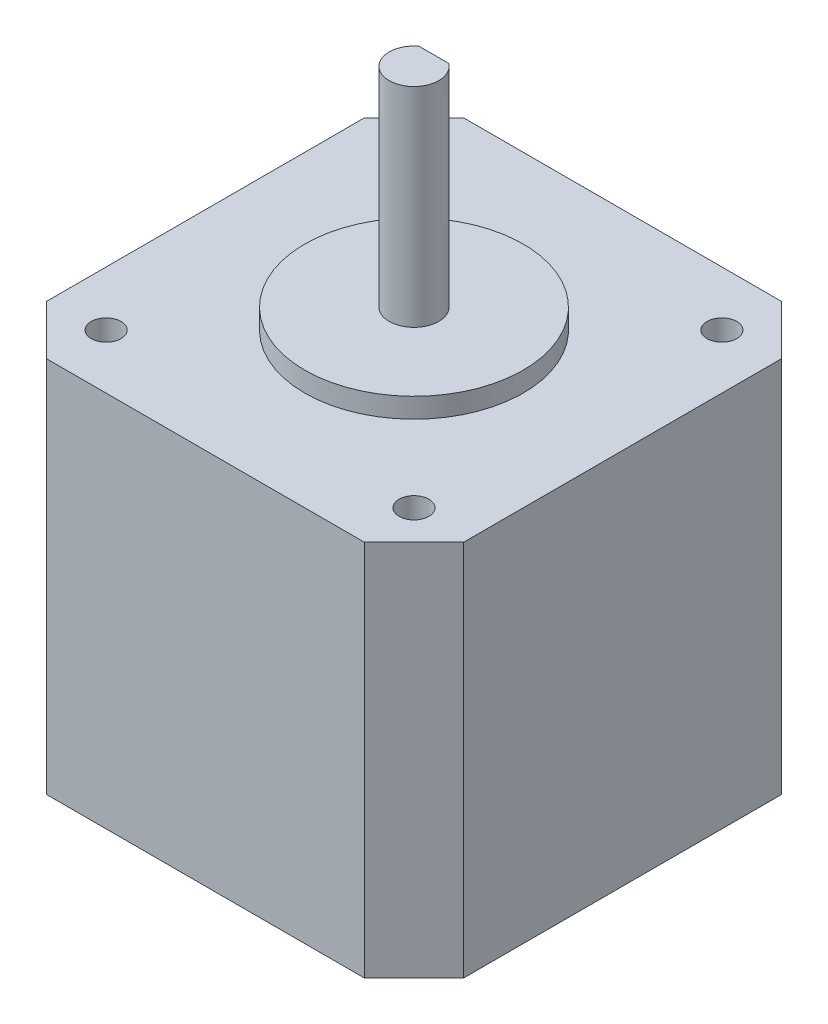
from build123d import *

# Parameters (mm, degrees)
SCHIZZO1_W                   = 42
SCHIZZO1_H                   = 42
ESTRUSIONE_ESTRUSIONE1_DEPTH = 38
SCHIZZO2_R                   = 11
ESTRUSIONE_ESTRUSIONE2_DEPTH = 2
SCHIZZO3_R                   = 2.5
ESTRUSIONE_ESTRUSIONE3_DEPTH = 21
SCHIZZO5_R                   = 1.5
TAGLIO_ESTRUSIONE8_DEPTH     = 10
SMUSSO1_SIZE                 = 5
SCHIZZO6_W                   = 6.915794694
SCHIZZO6_H                   = 1.569442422
TAGLIO_ESTRUSIONE9_DEPTH     = 19


with BuildPart() as part:
    # Schizzo1 → Estrusione-Estrusione1 (new body)
    with BuildSketch(Plane(origin=(0, 0, 0), x_dir=(1, 0, 0), z_dir=(0, 1, 0))):
        Rectangle(SCHIZZO1_W, SCHIZZO1_H)
    extrude(amount=ESTRUSIONE_ESTRUSIONE1_DEPTH)

    # Schizzo2 → Estrusione-Estrusione2 (add)
    with BuildSketch(Plane(origin=(0, 38, 0), x_dir=(1, 0, 0), z_dir=(0, 1, 0))):
        with Locations(Location((0, 0, 0), (0, 0, 270))):
            Circle(SCHIZZO2_R)
    extrude(amount=ESTRUSIONE_ESTRUSIONE2_DEPTH)

    # Schizzo3 → Estrusione-Estrusione3 (add)
    with BuildSketch(Plane(origin=(0, 40, 0), x_dir=(1, 0, 0), z_dir=(0, 1, 0))):
        with Locations(Location((0, 0, 0), (0, 0, 90))):
            Circle(SCHIZZO3_R)
    extrude(amount=ESTRUSIONE_ESTRUSIONE3_DEPTH)

    # Schizzo5 → Taglio-Estrusione8 (cut)
    with BuildSketch(Plane(origin=(0, 38, 0), x_dir=(1, 0, 0), z_dir=(0, 1, 0))):
        with Locations(Location((-15.5, 15.5, 0), (0, 0, 270))):
            Circle(SCHIZZO5_R)
        with Locations(Location((15.5, 15.5, 0), (0, 0, 90))):
            Circle(SCHIZZO5_R)
        with Locations(Location((15.5, -15.5, 0), (0, 0, 270))):
            Circle(SCHIZZO5_R)
        with Locations(Location((-15.5, -15.5, 0), (0, 0, 90))):
            Circle(SCHIZZO5_R)
    extrude(amount=-TAGLIO_ESTRUSIONE8_DEPTH, mode=Mode.SUBTRACT)

    # Smusso1
    smusso1_edges = [part.edges().sort_by_distance(p)[0] for p in [
        (-21, 19, -21),
        (21, 19, -21),
        (21, 19, 21),
        (-21, 19, 21),
    ]]
    chamfer(smusso1_edges, length=SMUSSO1_SIZE)

    # Schizzo6 → Taglio-Estrusione9 (cut)
    with BuildSketch(Plane(origin=(0, 61, 0), x_dir=(1, 0, 0), z_dir=(0, 1, 0))):
        with Locations((0, 2.784721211)):
            Rectangle(SCHIZZO6_W, SCHIZZO6_H)
    extrude(amount=-TAGLIO_ESTRUSIONE9_DEPTH, mode=Mode.SUBTRACT)


solid = part.part
